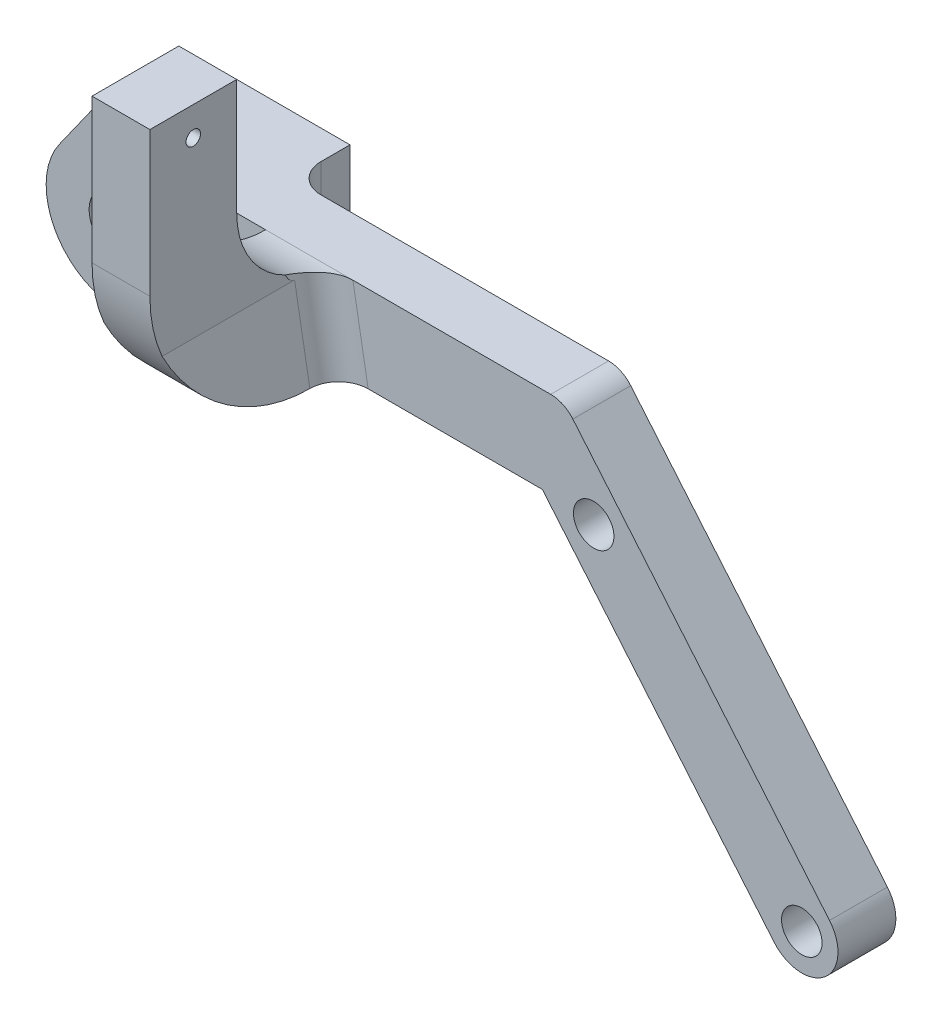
ISO-10303-21;
HEADER;
FILE_DESCRIPTION(('STEP AP214'),'2;1');
FILE_NAME('part.step','',(''),(''),'','','');
FILE_SCHEMA(('AUTOMOTIVE_DESIGN { 1 0 10303 214 1 1 1 1 }'));
ENDSEC;
DATA;
#1=APPLICATION_CONTEXT('core data for automotive mechanical design processes');
#2=APPLICATION_PROTOCOL_DEFINITION('international standard','automotive_design',2000,#1);
#3=PRODUCT_CONTEXT('',#1,'mechanical');
#4=PRODUCT('Part','Part','',(#3));
#5=PRODUCT_RELATED_PRODUCT_CATEGORY('part','',(#4));
#6=PRODUCT_DEFINITION_FORMATION('','',#4);
#7=PRODUCT_DEFINITION_CONTEXT('part definition',#1,'design');
#8=PRODUCT_DEFINITION('design','',#6,#7);
#9=PRODUCT_DEFINITION_SHAPE('','',#8);
#10=(LENGTH_UNIT() NAMED_UNIT(*) SI_UNIT(.MILLI.,.METRE.));
#11=(NAMED_UNIT(*) PLANE_ANGLE_UNIT() SI_UNIT($,.RADIAN.));
#12=(NAMED_UNIT(*) SI_UNIT($,.STERADIAN.) SOLID_ANGLE_UNIT());
#13=UNCERTAINTY_MEASURE_WITH_UNIT(LENGTH_MEASURE(1.E-05),#10,'distance_accuracy_value','');
#14=(GEOMETRIC_REPRESENTATION_CONTEXT(3) GLOBAL_UNCERTAINTY_ASSIGNED_CONTEXT((#13)) GLOBAL_UNIT_ASSIGNED_CONTEXT((#10,
#11,#12)) REPRESENTATION_CONTEXT('',''));
#15=CARTESIAN_POINT('',(0.,0.,0.));
#16=DIRECTION('',(0.,0.,1.));
#17=DIRECTION('',(1.,0.,0.));
#18=AXIS2_PLACEMENT_3D('',#15,#16,#17);
#19=CARTESIAN_POINT('',(16.9667619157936,11.9984192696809,2.54));
#20=DIRECTION('',(0.,0.,-1.));
#21=DIRECTION('',(1.,0.,0.));
#22=AXIS2_PLACEMENT_3D('',#19,#20,#21);
#23=PLANE('',#22);
#24=CARTESIAN_POINT('',(46.7893875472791,3.26204592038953,2.54));
#25=DIRECTION('',(0.,0.,-1.));
#26=DIRECTION('',(-1.,0.,0.));
#27=AXIS2_PLACEMENT_3D('',#24,#25,#26);
#28=CIRCLE('',#27,1.778);
#29=CARTESIAN_POINT('',(45.0113875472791,3.26204592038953,2.54));
#30=VERTEX_POINT('',#29);
#31=EDGE_CURVE('E392',#30,#30,#28,.T.);
#32=ORIENTED_EDGE('',*,*,#31,.F.);
#33=EDGE_LOOP('',(#32));
#34=FACE_BOUND('',#33,.T.);
#35=CARTESIAN_POINT('',(65.0583983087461,-18.5101132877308,2.54));
#36=DIRECTION('',(0.,0.,-1.));
#37=DIRECTION('',(-1.,0.,0.));
#38=AXIS2_PLACEMENT_3D('',#35,#36,#37);
#39=CIRCLE('',#38,1.77800000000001);
#40=CARTESIAN_POINT('',(63.2803983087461,-18.5101132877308,2.54));
#41=VERTEX_POINT('',#40);
#42=EDGE_CURVE('E387',#41,#41,#39,.T.);
#43=ORIENTED_EDGE('',*,*,#42,.F.);
#44=EDGE_LOOP('',(#43));
#45=FACE_BOUND('',#44,.T.);
#46=DIRECTION('',(-0.642787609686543,0.766044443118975,0.));
#47=VECTOR('',#46,1.);
#48=CARTESIAN_POINT('',(26.6311926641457,22.346223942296,2.54));
#49=LINE('',#48,#47);
#50=CARTESIAN_POINT('',(62.6262072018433,-20.5509639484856,2.54));
#51=VERTEX_POINT('',#50);
#52=CARTESIAN_POINT('',(42.5058682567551,3.42752227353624,2.54));
#53=VERTEX_POINT('',#52);
#54=EDGE_CURVE('E400',#51,#53,#49,.T.);
#55=ORIENTED_EDGE('',*,*,#54,.T.);
#56=CARTESIAN_POINT('',(44.4516211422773,5.06020280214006,2.54));
#57=DIRECTION('',(0.,0.,-1.));
#58=DIRECTION('',(-1.,0.,0.));
#59=AXIS2_PLACEMENT_3D('',#56,#57,#58);
#60=CIRCLE('',#59,2.54);
#61=CARTESIAN_POINT('',(42.3117442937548,3.69179969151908,2.54));
#62=VERTEX_POINT('',#61);
#63=EDGE_CURVE('E463',#53,#62,#60,.T.);
#64=ORIENTED_EDGE('',*,*,#63,.T.);
#65=DIRECTION('',(-1.,0.,0.));
#66=VECTOR('',#65,1.);
#67=CARTESIAN_POINT('',(0.,3.69179969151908,2.54));
#68=LINE('',#67,#66);
#69=CARTESIAN_POINT('',(17.78,3.69179969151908,2.54));
#70=VERTEX_POINT('',#69);
#71=EDGE_CURVE('E396',#62,#70,#68,.T.);
#72=ORIENTED_EDGE('',*,*,#71,.T.);
#73=DIRECTION('',(0.,1.,0.));
#74=VECTOR('',#73,1.);
#75=CARTESIAN_POINT('',(17.78,11.2863996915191,2.54));
#76=LINE('',#75,#74);
#77=CARTESIAN_POINT('',(17.78,11.2863996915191,2.54));
#78=VERTEX_POINT('',#77);
#79=EDGE_CURVE('E446',#70,#78,#76,.T.);
#80=ORIENTED_EDGE('',*,*,#79,.T.);
#81=DIRECTION('',(1.,0.,0.));
#82=VECTOR('',#81,1.);
#83=CARTESIAN_POINT('',(0.,11.2863996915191,2.54));
#84=LINE('',#83,#82);
#85=CARTESIAN_POINT('',(43.0164019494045,11.2863996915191,2.54));
#86=VERTEX_POINT('',#85);
#87=EDGE_CURVE('E395',#78,#86,#84,.T.);
#88=ORIENTED_EDGE('',*,*,#87,.T.);
#89=CARTESIAN_POINT('',(43.0164019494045,8.74639969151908,2.54));
#90=DIRECTION('',(0.,0.,-1.));
#91=DIRECTION('',(-1.,0.,0.));
#92=AXIS2_PLACEMENT_3D('',#89,#90,#91);
#93=CIRCLE('',#92,2.54);
#94=CARTESIAN_POINT('',(44.9621548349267,10.3790802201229,2.54));
#95=VERTEX_POINT('',#94);
#96=EDGE_CURVE('E461',#86,#95,#93,.T.);
#97=ORIENTED_EDGE('',*,*,#96,.T.);
#98=DIRECTION('',(0.642787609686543,-0.766044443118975,0.));
#99=VECTOR('',#98,1.);
#100=CARTESIAN_POINT('',(31.4955748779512,26.4279252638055,2.54));
#101=LINE('',#100,#99);
#102=CARTESIAN_POINT('',(67.4905894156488,-16.4692626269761,2.54));
#103=VERTEX_POINT('',#102);
#104=EDGE_CURVE('E406',#95,#103,#101,.T.);
#105=ORIENTED_EDGE('',*,*,#104,.T.);
#106=CARTESIAN_POINT('',(65.0583983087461,-18.5101132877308,2.54));
#107=DIRECTION('',(0.,0.,-1.));
#108=DIRECTION('',(-1.,0.,0.));
#109=AXIS2_PLACEMENT_3D('',#106,#107,#108);
#110=CIRCLE('',#109,3.175);
#111=EDGE_CURVE('E403',#103,#51,#110,.T.);
#112=ORIENTED_EDGE('',*,*,#111,.T.);
#113=EDGE_LOOP('',(#55,#64,#72,#80,#88,#97,#105,#112));
#114=FACE_BOUND('',#113,.T.);
#115=ADVANCED_FACE('F109',(#34,#45,#114),#23,.T.);
#116=CARTESIAN_POINT('',(23.0767428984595,0.,22.86));
#117=DIRECTION('',(-1.,0.,0.));
#118=DIRECTION('',(0.,-1.,0.));
#119=AXIS2_PLACEMENT_3D('',#116,#117,#118);
#120=PLANE('',#119);
#121=CARTESIAN_POINT('',(23.0767428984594,26.5263996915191,19.05));
#122=DIRECTION('',(-1.,0.,0.));
#123=DIRECTION('',(0.,-1.,0.));
#124=AXIS2_PLACEMENT_3D('',#121,#122,#123);
#125=CIRCLE('',#124,0.634999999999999);
#126=CARTESIAN_POINT('',(23.0767428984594,25.8913996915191,19.05));
#127=VERTEX_POINT('',#126);
#128=EDGE_CURVE('E932',#127,#127,#125,.T.);
#129=ORIENTED_EDGE('',*,*,#128,.T.);
#130=EDGE_LOOP('',(#129));
#131=FACE_BOUND('',#130,.T.);
#132=DIRECTION('',(0.,1.,0.));
#133=VECTOR('',#132,1.);
#134=CARTESIAN_POINT('',(23.0767428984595,0.,22.86));
#135=LINE('',#134,#133);
#136=CARTESIAN_POINT('',(23.0767428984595,16.3917996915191,22.86));
#137=VERTEX_POINT('',#136);
#138=CARTESIAN_POINT('',(23.0767428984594,29.0663996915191,22.86));
#139=VERTEX_POINT('',#138);
#140=EDGE_CURVE('E322',#137,#139,#135,.T.);
#141=ORIENTED_EDGE('',*,*,#140,.F.);
#142=CARTESIAN_POINT('',(23.0767428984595,16.3917996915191,10.16));
#143=DIRECTION('',(-1.,0.,0.));
#144=DIRECTION('',(0.,-1.,0.));
#145=AXIS2_PLACEMENT_3D('',#142,#143,#144);
#146=CIRCLE('',#145,12.7);
#147=CARTESIAN_POINT('',(23.0767428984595,11.2863996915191,21.7886237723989));
#148=VERTEX_POINT('',#147);
#149=EDGE_CURVE('E117',#137,#148,#146,.F.);
#150=ORIENTED_EDGE('',*,*,#149,.T.);
#151=DIRECTION('',(0.,0.,-1.));
#152=VECTOR('',#151,1.);
#153=CARTESIAN_POINT('',(23.0767428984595,11.2863996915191,22.86));
#154=LINE('',#153,#152);
#155=CARTESIAN_POINT('',(23.0767428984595,11.2863996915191,10.16));
#156=VERTEX_POINT('',#155);
#157=EDGE_CURVE('E315',#148,#156,#154,.T.);
#158=ORIENTED_EDGE('',*,*,#157,.T.);
#159=CARTESIAN_POINT('',(23.0767428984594,25.9136767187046,10.16));
#160=DIRECTION('',(-1.,0.,0.));
#161=DIRECTION('',(0.,-1.,0.));
#162=AXIS2_PLACEMENT_3D('',#159,#160,#161);
#163=ELLIPSE('',#162,14.6272770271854,2.54);
#164=CARTESIAN_POINT('',(23.0767428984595,12.0663803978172,10.9783531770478));
#165=VERTEX_POINT('',#164);
#166=EDGE_CURVE('E631',#156,#165,#163,.T.);
#167=ORIENTED_EDGE('',*,*,#166,.T.);
#168=CARTESIAN_POINT('',(23.0767428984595,18.9063996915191,7.62));
#169=DIRECTION('',(-1.,0.,0.));
#170=DIRECTION('',(0.,-1.,0.));
#171=AXIS2_PLACEMENT_3D('',#168,#169,#170);
#172=CIRCLE('',#171,7.62);
#173=CARTESIAN_POINT('',(23.0767428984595,18.9063996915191,15.24));
#174=VERTEX_POINT('',#173);
#175=EDGE_CURVE('E503',#165,#174,#172,.T.);
#176=ORIENTED_EDGE('',*,*,#175,.T.);
#177=DIRECTION('',(0.,-1.,0.));
#178=VECTOR('',#177,1.);
#179=CARTESIAN_POINT('',(23.0767428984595,0.,15.24));
#180=LINE('',#179,#178);
#181=CARTESIAN_POINT('',(23.0767428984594,29.0663996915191,15.24));
#182=VERTEX_POINT('',#181);
#183=EDGE_CURVE('E298',#182,#174,#180,.T.);
#184=ORIENTED_EDGE('',*,*,#183,.F.);
#185=DIRECTION('',(0.,0.,-1.));
#186=VECTOR('',#185,1.);
#187=CARTESIAN_POINT('',(23.0767428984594,29.0663996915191,22.86));
#188=LINE('',#187,#186);
#189=EDGE_CURVE('E307',#139,#182,#188,.T.);
#190=ORIENTED_EDGE('',*,*,#189,.F.);
#191=EDGE_LOOP('',(#141,#150,#158,#167,#176,#184,#190));
#192=FACE_BOUND('',#191,.T.);
#193=ADVANCED_FACE('F542',(#131,#192),#120,.F.);
#194=CARTESIAN_POINT('',(0.,29.0663996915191,22.86));
#195=DIRECTION('',(0.,-1.,0.));
#196=DIRECTION('',(1.,0.,0.));
#197=AXIS2_PLACEMENT_3D('',#194,#195,#196);
#198=PLANE('',#197);
#199=DIRECTION('',(1.,0.,0.));
#200=VECTOR('',#199,1.);
#201=CARTESIAN_POINT('',(0.,29.0663996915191,15.24));
#202=LINE('',#201,#200);
#203=CARTESIAN_POINT('',(17.9967428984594,29.0663996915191,15.24));
#204=VERTEX_POINT('',#203);
#205=EDGE_CURVE('E291',#204,#182,#202,.T.);
#206=ORIENTED_EDGE('',*,*,#205,.F.);
#207=DIRECTION('',(0.,0.,-1.));
#208=VECTOR('',#207,1.);
#209=CARTESIAN_POINT('',(17.9967428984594,29.0663996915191,22.86));
#210=LINE('',#209,#208);
#211=CARTESIAN_POINT('',(17.9967428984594,29.0663996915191,22.86));
#212=VERTEX_POINT('',#211);
#213=EDGE_CURVE('E305',#212,#204,#210,.T.);
#214=ORIENTED_EDGE('',*,*,#213,.F.);
#215=DIRECTION('',(-1.,0.,0.));
#216=VECTOR('',#215,1.);
#217=CARTESIAN_POINT('',(0.,29.0663996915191,22.86));
#218=LINE('',#217,#216);
#219=EDGE_CURVE('E642',#139,#212,#218,.T.);
#220=ORIENTED_EDGE('',*,*,#219,.F.);
#221=ORIENTED_EDGE('',*,*,#189,.T.);
#222=EDGE_LOOP('',(#206,#214,#220,#221));
#223=FACE_BOUND('',#222,.T.);
#224=ADVANCED_FACE('F303',(#223),#198,.F.);
#225=CARTESIAN_POINT('',(17.9967428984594,0.,22.86));
#226=DIRECTION('',(-1.,0.,0.));
#227=DIRECTION('',(0.,-1.,0.));
#228=AXIS2_PLACEMENT_3D('',#225,#226,#227);
#229=PLANE('',#228);
#230=CARTESIAN_POINT('',(17.9967428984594,26.5263996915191,19.05));
#231=DIRECTION('',(-1.,0.,0.));
#232=DIRECTION('',(0.,-1.,0.));
#233=AXIS2_PLACEMENT_3D('',#230,#231,#232);
#234=CIRCLE('',#233,0.634999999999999);
#235=CARTESIAN_POINT('',(17.9967428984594,25.8913996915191,19.05));
#236=VERTEX_POINT('',#235);
#237=EDGE_CURVE('E931',#236,#236,#234,.T.);
#238=ORIENTED_EDGE('',*,*,#237,.F.);
#239=EDGE_LOOP('',(#238));
#240=FACE_BOUND('',#239,.T.);
#241=DIRECTION('',(0.,0.,-1.));
#242=VECTOR('',#241,1.);
#243=CARTESIAN_POINT('',(17.9967428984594,11.2863996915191,22.86));
#244=LINE('',#243,#242);
#245=CARTESIAN_POINT('',(17.9967428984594,11.2863996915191,21.7886237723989));
#246=VERTEX_POINT('',#245);
#247=CARTESIAN_POINT('',(17.9967428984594,11.2863996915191,7.62));
#248=VERTEX_POINT('',#247);
#249=EDGE_CURVE('E313',#246,#248,#244,.T.);
#250=ORIENTED_EDGE('',*,*,#249,.F.);
#251=CARTESIAN_POINT('',(17.9967428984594,16.3917996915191,10.16));
#252=DIRECTION('',(-1.,0.,0.));
#253=DIRECTION('',(0.,-1.,0.));
#254=AXIS2_PLACEMENT_3D('',#251,#252,#253);
#255=CIRCLE('',#254,12.7);
#256=CARTESIAN_POINT('',(17.9967428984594,16.3917996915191,22.86));
#257=VERTEX_POINT('',#256);
#258=EDGE_CURVE('E637',#246,#257,#255,.T.);
#259=ORIENTED_EDGE('',*,*,#258,.T.);
#260=DIRECTION('',(0.,1.,0.));
#261=VECTOR('',#260,1.);
#262=CARTESIAN_POINT('',(17.9967428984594,0.,22.86));
#263=LINE('',#262,#261);
#264=EDGE_CURVE('E308',#257,#212,#263,.T.);
#265=ORIENTED_EDGE('',*,*,#264,.T.);
#266=ORIENTED_EDGE('',*,*,#213,.T.);
#267=DIRECTION('',(0.,-1.,0.));
#268=VECTOR('',#267,1.);
#269=CARTESIAN_POINT('',(17.9967428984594,0.,15.24));
#270=LINE('',#269,#268);
#271=CARTESIAN_POINT('',(17.9967428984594,18.9063996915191,15.24));
#272=VERTEX_POINT('',#271);
#273=EDGE_CURVE('E287',#204,#272,#270,.T.);
#274=ORIENTED_EDGE('',*,*,#273,.T.);
#275=CARTESIAN_POINT('',(17.9967428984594,18.9063996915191,7.62));
#276=DIRECTION('',(-1.,0.,0.));
#277=DIRECTION('',(0.,-1.,0.));
#278=AXIS2_PLACEMENT_3D('',#275,#276,#277);
#279=CIRCLE('',#278,7.62);
#280=EDGE_CURVE('E495',#272,#248,#279,.F.);
#281=ORIENTED_EDGE('',*,*,#280,.T.);
#282=EDGE_LOOP('',(#250,#259,#265,#266,#274,#281));
#283=FACE_BOUND('',#282,.T.);
#284=ADVANCED_FACE('F311',(#240,#283),#229,.T.);
#285=CARTESIAN_POINT('',(16.9667619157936,11.9984192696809,7.62));
#286=DIRECTION('',(0.,0.,-1.));
#287=DIRECTION('',(1.,0.,0.));
#288=AXIS2_PLACEMENT_3D('',#285,#286,#287);
#289=PLANE('',#288);
#290=CARTESIAN_POINT('',(65.0583983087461,-18.5101132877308,7.62));
#291=DIRECTION('',(0.,0.,-1.));
#292=DIRECTION('',(-1.,0.,0.));
#293=AXIS2_PLACEMENT_3D('',#290,#291,#292);
#294=CIRCLE('',#293,1.77800000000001);
#295=CARTESIAN_POINT('',(63.2803983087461,-18.5101132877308,7.62));
#296=VERTEX_POINT('',#295);
#297=EDGE_CURVE('E391',#296,#296,#294,.F.);
#298=ORIENTED_EDGE('',*,*,#297,.F.);
#299=EDGE_LOOP('',(#298));
#300=FACE_BOUND('',#299,.T.);
#301=CARTESIAN_POINT('',(46.7893875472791,3.26204592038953,7.62));
#302=DIRECTION('',(0.,0.,-1.));
#303=DIRECTION('',(-1.,0.,0.));
#304=AXIS2_PLACEMENT_3D('',#301,#302,#303);
#305=CIRCLE('',#304,1.778);
#306=CARTESIAN_POINT('',(45.0113875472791,3.26204592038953,7.62));
#307=VERTEX_POINT('',#306);
#308=EDGE_CURVE('E390',#307,#307,#305,.F.);
#309=ORIENTED_EDGE('',*,*,#308,.F.);
#310=EDGE_LOOP('',(#309));
#311=FACE_BOUND('',#310,.T.);
#312=DIRECTION('',(1.,0.,0.));
#313=VECTOR('',#312,1.);
#314=CARTESIAN_POINT('',(0.,3.69179969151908,7.62));
#315=LINE('',#314,#313);
#316=CARTESIAN_POINT('',(26.9950593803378,3.69179969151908,7.62));
#317=VERTEX_POINT('',#316);
#318=CARTESIAN_POINT('',(42.3117442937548,3.69179969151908,7.62));
#319=VERTEX_POINT('',#318);
#320=EDGE_CURVE('E399',#317,#319,#315,.T.);
#321=ORIENTED_EDGE('',*,*,#320,.T.);
#322=CARTESIAN_POINT('',(44.4516211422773,5.06020280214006,7.62));
#323=DIRECTION('',(0.,0.,-1.));
#324=DIRECTION('',(-1.,0.,0.));
#325=AXIS2_PLACEMENT_3D('',#322,#323,#324);
#326=CIRCLE('',#325,2.54);
#327=CARTESIAN_POINT('',(42.5058682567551,3.42752227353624,7.62));
#328=VERTEX_POINT('',#327);
#329=EDGE_CURVE('E467',#319,#328,#326,.F.);
#330=ORIENTED_EDGE('',*,*,#329,.T.);
#331=DIRECTION('',(0.642787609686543,-0.766044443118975,0.));
#332=VECTOR('',#331,1.);
#333=CARTESIAN_POINT('',(26.6311926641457,22.346223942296,7.62));
#334=LINE('',#333,#332);
#335=CARTESIAN_POINT('',(62.6262072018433,-20.5509639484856,7.62));
#336=VERTEX_POINT('',#335);
#337=EDGE_CURVE('E424',#328,#336,#334,.T.);
#338=ORIENTED_EDGE('',*,*,#337,.T.);
#339=CARTESIAN_POINT('',(65.0583983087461,-18.5101132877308,7.62));
#340=DIRECTION('',(0.,0.,-1.));
#341=DIRECTION('',(-1.,0.,0.));
#342=AXIS2_PLACEMENT_3D('',#339,#340,#341);
#343=CIRCLE('',#342,3.175);
#344=CARTESIAN_POINT('',(67.4905894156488,-16.4692626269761,7.62));
#345=VERTEX_POINT('',#344);
#346=EDGE_CURVE('E426',#336,#345,#343,.F.);
#347=ORIENTED_EDGE('',*,*,#346,.T.);
#348=DIRECTION('',(-0.642787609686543,0.766044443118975,0.));
#349=VECTOR('',#348,1.);
#350=CARTESIAN_POINT('',(31.4955748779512,26.4279252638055,7.62));
#351=LINE('',#350,#349);
#352=CARTESIAN_POINT('',(44.9621548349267,10.3790802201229,7.62));
#353=VERTEX_POINT('',#352);
#354=EDGE_CURVE('E428',#345,#353,#351,.T.);
#355=ORIENTED_EDGE('',*,*,#354,.T.);
#356=CARTESIAN_POINT('',(43.0164019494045,8.74639969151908,7.62));
#357=DIRECTION('',(0.,0.,-1.));
#358=DIRECTION('',(-1.,0.,0.));
#359=AXIS2_PLACEMENT_3D('',#356,#357,#358);
#360=CIRCLE('',#359,2.54);
#361=CARTESIAN_POINT('',(43.0164019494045,11.2863996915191,7.62));
#362=VERTEX_POINT('',#361);
#363=EDGE_CURVE('E465',#353,#362,#360,.F.);
#364=ORIENTED_EDGE('',*,*,#363,.T.);
#365=DIRECTION('',(-1.,0.,0.));
#366=VECTOR('',#365,1.);
#367=CARTESIAN_POINT('',(0.,11.2863996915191,7.62));
#368=LINE('',#367,#366);
#369=CARTESIAN_POINT('',(25.6559264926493,11.2863996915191,7.62));
#370=VERTEX_POINT('',#369);
#371=EDGE_CURVE('E432',#362,#370,#368,.T.);
#372=ORIENTED_EDGE('',*,*,#371,.T.);
#373=DIRECTION('',(0.173648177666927,-0.984807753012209,0.));
#374=VECTOR('',#373,1.);
#375=CARTESIAN_POINT('',(25.2721536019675,13.4628839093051,7.62));
#376=LINE('',#375,#374);
#377=EDGE_CURVE('E440',#370,#317,#376,.T.);
#378=ORIENTED_EDGE('',*,*,#377,.T.);
#379=EDGE_LOOP('',(#321,#330,#338,#347,#355,#364,#372,#378));
#380=FACE_BOUND('',#379,.T.);
#381=ADVANCED_FACE('F560',(#300,#311,#380),#289,.F.);
#382=CARTESIAN_POINT('',(10.16,3.69179969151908,7.62));
#383=VERTEX_POINT('',#382);
#384=CARTESIAN_POINT('',(19.3358757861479,3.69179969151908,7.62));
#385=VERTEX_POINT('',#384);
#386=EDGE_CURVE('E421',#383,#385,#315,.T.);
#387=ORIENTED_EDGE('',*,*,#386,.T.);
#388=DIRECTION('',(-0.173648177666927,0.984807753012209,0.));
#389=VECTOR('',#388,1.);
#390=CARTESIAN_POINT('',(17.8439226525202,12.1530863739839,7.62));
#391=LINE('',#390,#389);
#392=EDGE_CURVE('E323',#385,#248,#391,.T.);
#393=ORIENTED_EDGE('',*,*,#392,.T.);
#394=CARTESIAN_POINT('',(10.16,11.2863996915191,7.62));
#395=VERTEX_POINT('',#394);
#396=EDGE_CURVE('E431',#248,#395,#368,.T.);
#397=ORIENTED_EDGE('',*,*,#396,.T.);
#398=DIRECTION('',(0.,-1.,0.));
#399=VECTOR('',#398,1.);
#400=CARTESIAN_POINT('',(10.16,11.9984192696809,7.62));
#401=LINE('',#400,#399);
#402=EDGE_CURVE('E343',#395,#383,#401,.T.);
#403=ORIENTED_EDGE('',*,*,#402,.T.);
#404=EDGE_LOOP('',(#387,#393,#397,#403));
#405=FACE_BOUND('',#404,.T.);
#406=ADVANCED_FACE('F556',(#405),#289,.F.);
#407=CARTESIAN_POINT('',(0.,11.2863996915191,89.1663302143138));
#408=DIRECTION('',(0.,1.,0.));
#409=DIRECTION('',(0.,0.,1.));
#410=AXIS2_PLACEMENT_3D('',#407,#408,#409);
#411=PLANE('',#410);
#412=ORIENTED_EDGE('',*,*,#396,.F.);
#413=DIRECTION('',(-1.,0.,0.));
#414=VECTOR('',#413,1.);
#415=CARTESIAN_POINT('',(23.0767428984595,11.2863996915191,7.62));
#416=LINE('',#415,#414);
#417=EDGE_CURVE('E493',#248,#370,#416,.F.);
#418=ORIENTED_EDGE('',*,*,#417,.T.);
#419=ORIENTED_EDGE('',*,*,#371,.F.);
#420=DIRECTION('',(0.,0.,-1.));
#421=VECTOR('',#420,1.);
#422=CARTESIAN_POINT('',(43.0164019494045,11.2863996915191,89.1663302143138));
#423=LINE('',#422,#421);
#424=EDGE_CURVE('E471',#362,#86,#423,.T.);
#425=ORIENTED_EDGE('',*,*,#424,.T.);
#426=ORIENTED_EDGE('',*,*,#87,.F.);
#427=CARTESIAN_POINT('',(17.78,11.2863996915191,0.));
#428=DIRECTION('',(0.,1.,0.));
#429=DIRECTION('',(0.,0.,1.));
#430=AXIS2_PLACEMENT_3D('',#427,#428,#429);
#431=CIRCLE('',#430,2.54);
#432=CARTESIAN_POINT('',(15.24,11.2863996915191,0.));
#433=VERTEX_POINT('',#432);
#434=EDGE_CURVE('E454',#78,#433,#431,.F.);
#435=ORIENTED_EDGE('',*,*,#434,.T.);
#436=DIRECTION('',(0.,0.,1.));
#437=VECTOR('',#436,1.);
#438=CARTESIAN_POINT('',(15.24,11.2863996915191,-2.54));
#439=LINE('',#438,#437);
#440=CARTESIAN_POINT('',(15.24,11.2863996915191,-2.54));
#441=VERTEX_POINT('',#440);
#442=EDGE_CURVE('E378',#441,#433,#439,.T.);
#443=ORIENTED_EDGE('',*,*,#442,.F.);
#444=DIRECTION('',(1.,0.,0.));
#445=VECTOR('',#444,1.);
#446=CARTESIAN_POINT('',(0.,11.2863996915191,-2.54));
#447=LINE('',#446,#445);
#448=CARTESIAN_POINT('',(1.52968776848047,11.2863996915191,-2.54));
#449=VERTEX_POINT('',#448);
#450=EDGE_CURVE('E364',#449,#441,#447,.T.);
#451=ORIENTED_EDGE('',*,*,#450,.F.);
#452=DIRECTION('',(0.,0.,-1.));
#453=VECTOR('',#452,1.);
#454=CARTESIAN_POINT('',(1.52968776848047,11.2863996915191,89.1663302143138));
#455=LINE('',#454,#453);
#456=CARTESIAN_POINT('',(1.52968776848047,11.2863996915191,2.54));
#457=VERTEX_POINT('',#456);
#458=EDGE_CURVE('E469',#449,#457,#455,.F.);
#459=ORIENTED_EDGE('',*,*,#458,.T.);
#460=DIRECTION('',(1.,0.,0.));
#461=VECTOR('',#460,1.);
#462=CARTESIAN_POINT('',(16.9667619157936,11.2863996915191,2.54));
#463=LINE('',#462,#461);
#464=CARTESIAN_POINT('',(10.16,11.2863996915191,2.54));
#465=VERTEX_POINT('',#464);
#466=EDGE_CURVE('E338',#457,#465,#463,.T.);
#467=ORIENTED_EDGE('',*,*,#466,.T.);
#468=DIRECTION('',(0.,0.,1.));
#469=VECTOR('',#468,1.);
#470=CARTESIAN_POINT('',(10.16,11.2863996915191,-21.6182841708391));
#471=LINE('',#470,#469);
#472=EDGE_CURVE('E347',#465,#395,#471,.T.);
#473=ORIENTED_EDGE('',*,*,#472,.T.);
#474=EDGE_LOOP('',(#412,#418,#419,#425,#426,#435,#443,#451,#459,#467,#473));
#475=FACE_BOUND('',#474,.T.);
#476=ADVANCED_FACE('F559',(#475),#411,.T.);
#477=CARTESIAN_POINT('',(0.,3.69179969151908,89.1663302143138));
#478=DIRECTION('',(0.,-1.,0.));
#479=DIRECTION('',(0.,0.,-1.));
#480=AXIS2_PLACEMENT_3D('',#477,#478,#479);
#481=PLANE('',#480);
#482=CARTESIAN_POINT('',(26.9950593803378,3.69179969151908,10.16));
#483=DIRECTION('',(0.,-1.,0.));
#484=DIRECTION('',(1.,0.,0.));
#485=AXIS2_PLACEMENT_3D('',#482,#483,#484);
#486=ELLIPSE('',#485,2.57918359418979,2.54);
#487=CARTESIAN_POINT('',(24.415875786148,3.69179969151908,10.16));
#488=VERTEX_POINT('',#487);
#489=EDGE_CURVE('E451',#317,#488,#486,.F.);
#490=ORIENTED_EDGE('',*,*,#489,.T.);
#491=DIRECTION('',(-1.,0.,0.));
#492=VECTOR('',#491,1.);
#493=CARTESIAN_POINT('',(19.3358757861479,3.69179969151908,10.16));
#494=LINE('',#493,#492);
#495=CARTESIAN_POINT('',(19.3358757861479,3.69179969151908,10.16));
#496=VERTEX_POINT('',#495);
#497=EDGE_CURVE('E632',#488,#496,#494,.T.);
#498=ORIENTED_EDGE('',*,*,#497,.T.);
#499=DIRECTION('',(0.,0.,-1.));
#500=VECTOR('',#499,1.);
#501=CARTESIAN_POINT('',(19.3358757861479,3.69179969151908,22.86));
#502=LINE('',#501,#500);
#503=EDGE_CURVE('E317',#496,#385,#502,.T.);
#504=ORIENTED_EDGE('',*,*,#503,.T.);
#505=ORIENTED_EDGE('',*,*,#386,.F.);
#506=DIRECTION('',(0.,0.,1.));
#507=VECTOR('',#506,1.);
#508=CARTESIAN_POINT('',(10.16,3.69179969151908,-21.6182841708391));
#509=LINE('',#508,#507);
#510=CARTESIAN_POINT('',(10.16,3.69179969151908,2.54));
#511=VERTEX_POINT('',#510);
#512=EDGE_CURVE('E346',#511,#383,#509,.T.);
#513=ORIENTED_EDGE('',*,*,#512,.F.);
#514=DIRECTION('',(-1.,0.,0.));
#515=VECTOR('',#514,1.);
#516=CARTESIAN_POINT('',(16.9667619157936,3.69179969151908,2.54));
#517=LINE('',#516,#515);
#518=CARTESIAN_POINT('',(9.95784650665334,3.69179969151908,2.54));
#519=VERTEX_POINT('',#518);
#520=EDGE_CURVE('E332',#511,#519,#517,.T.);
#521=ORIENTED_EDGE('',*,*,#520,.T.);
#522=DIRECTION('',(0.,0.,-1.));
#523=VECTOR('',#522,1.);
#524=CARTESIAN_POINT('',(9.95784650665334,3.69179969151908,-2.54));
#525=LINE('',#524,#523);
#526=CARTESIAN_POINT('',(9.95784650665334,3.69179969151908,-2.54));
#527=VERTEX_POINT('',#526);
#528=EDGE_CURVE('E483',#519,#527,#525,.T.);
#529=ORIENTED_EDGE('',*,*,#528,.T.);
#530=DIRECTION('',(-1.,0.,0.));
#531=VECTOR('',#530,1.);
#532=CARTESIAN_POINT('',(0.,3.69179969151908,-2.54));
#533=LINE('',#532,#531);
#534=CARTESIAN_POINT('',(15.24,3.69179969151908,-2.54));
#535=VERTEX_POINT('',#534);
#536=EDGE_CURVE('E369',#535,#527,#533,.T.);
#537=ORIENTED_EDGE('',*,*,#536,.F.);
#538=DIRECTION('',(0.,0.,1.));
#539=VECTOR('',#538,1.);
#540=CARTESIAN_POINT('',(15.24,3.69179969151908,-2.54));
#541=LINE('',#540,#539);
#542=CARTESIAN_POINT('',(15.24,3.69179969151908,0.));
#543=VERTEX_POINT('',#542);
#544=EDGE_CURVE('E375',#535,#543,#541,.T.);
#545=ORIENTED_EDGE('',*,*,#544,.T.);
#546=CARTESIAN_POINT('',(17.78,3.69179969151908,0.));
#547=DIRECTION('',(0.,-1.,0.));
#548=DIRECTION('',(0.,0.,-1.));
#549=AXIS2_PLACEMENT_3D('',#546,#547,#548);
#550=CIRCLE('',#549,2.54);
#551=EDGE_CURVE('E456',#543,#70,#550,.F.);
#552=ORIENTED_EDGE('',*,*,#551,.T.);
#553=ORIENTED_EDGE('',*,*,#71,.F.);
#554=DIRECTION('',(0.,0.,-1.));
#555=VECTOR('',#554,1.);
#556=CARTESIAN_POINT('',(42.3117442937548,3.69179969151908,89.1663302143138));
#557=LINE('',#556,#555);
#558=EDGE_CURVE('E386',#319,#62,#557,.T.);
#559=ORIENTED_EDGE('',*,*,#558,.F.);
#560=ORIENTED_EDGE('',*,*,#320,.F.);
#561=EDGE_LOOP('',(#490,#498,#504,#505,#513,#521,#529,#537,#545,#552,#553,#559,#560));
#562=FACE_BOUND('',#561,.T.);
#563=ADVANCED_FACE('F567',(#562),#481,.T.);
#564=CARTESIAN_POINT('',(-16.9667619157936,11.9984192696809,2.54));
#565=DIRECTION('',(0.,0.,1.));
#566=DIRECTION('',(-1.,0.,0.));
#567=AXIS2_PLACEMENT_3D('',#564,#565,#566);
#568=CYLINDRICAL_SURFACE('',#567,14.4305937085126);
#569=DIRECTION('',(0.,0.,1.));
#570=VECTOR('',#569,1.);
#571=CARTESIAN_POINT('',(-5.18459384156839,3.66639969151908,2.54));
#572=LINE('',#571,#570);
#573=CARTESIAN_POINT('',(-5.18459384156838,3.66639969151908,-2.54));
#574=VERTEX_POINT('',#573);
#575=CARTESIAN_POINT('',(-5.18459384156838,3.66639969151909,2.54));
#576=VERTEX_POINT('',#575);
#577=EDGE_CURVE('E435',#574,#576,#572,.T.);
#578=ORIENTED_EDGE('',*,*,#577,.T.);
#579=DIRECTION('',(0.578291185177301,0.815830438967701,0.));
#580=VECTOR('',#579,1.);
#581=CARTESIAN_POINT('',(6.15421787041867,19.6627556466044,2.54));
#582=LINE('',#581,#580);
#583=CARTESIAN_POINT('',(-5.18052098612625,3.67215227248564,2.54));
#584=VERTEX_POINT('',#583);
#585=EDGE_CURVE('E340',#576,#584,#582,.T.);
#586=ORIENTED_EDGE('',*,*,#585,.T.);
#587=DIRECTION('',(0.,0.,-1.));
#588=VECTOR('',#587,1.);
#589=CARTESIAN_POINT('',(-5.18052788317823,3.67215227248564,12.7));
#590=LINE('',#589,#588);
#591=CARTESIAN_POINT('',(-5.18052788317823,3.67215227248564,-2.54));
#592=VERTEX_POINT('',#591);
#593=EDGE_CURVE('E384',#584,#592,#590,.T.);
#594=ORIENTED_EDGE('',*,*,#593,.T.);
#595=CARTESIAN_POINT('',(-16.9667619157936,11.9984192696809,-2.54));
#596=DIRECTION('',(0.,0.,-1.));
#597=DIRECTION('',(-1.,0.,0.));
#598=AXIS2_PLACEMENT_3D('',#595,#596,#597);
#599=CIRCLE('',#598,14.4305937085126);
#600=EDGE_CURVE('E358',#574,#592,#599,.F.);
#601=ORIENTED_EDGE('',*,*,#600,.F.);
#602=EDGE_LOOP('',(#578,#586,#594,#601));
#603=FACE_BOUND('',#602,.T.);
#604=ADVANCED_FACE('F564',(#603),#568,.F.);
#605=CARTESIAN_POINT('',(0.,0.,2.54));
#606=DIRECTION('',(0.,0.,1.));
#607=DIRECTION('',(-1.,0.,0.));
#608=AXIS2_PLACEMENT_3D('',#605,#606,#607);
#609=CYLINDRICAL_SURFACE('',#608,6.35);
#610=DIRECTION('',(0.,0.,-1.));
#611=VECTOR('',#610,1.);
#612=CARTESIAN_POINT('',(5.93133001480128,-2.26755909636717,12.7));
#613=LINE('',#612,#611);
#614=CARTESIAN_POINT('',(5.93133001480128,-2.26755909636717,2.54));
#615=VERTEX_POINT('',#614);
#616=CARTESIAN_POINT('',(5.93133001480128,-2.26755909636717,-2.54));
#617=VERTEX_POINT('',#616);
#618=EDGE_CURVE('E381',#615,#617,#613,.T.);
#619=ORIENTED_EDGE('',*,*,#618,.F.);
#620=CARTESIAN_POINT('',(0.,0.,2.54));
#621=DIRECTION('',(0.,0.,-1.));
#622=DIRECTION('',(-1.,0.,0.));
#623=AXIS2_PLACEMENT_3D('',#620,#621,#622);
#624=CIRCLE('',#623,6.35);
#625=EDGE_CURVE('E327',#615,#576,#624,.T.);
#626=ORIENTED_EDGE('',*,*,#625,.T.);
#627=ORIENTED_EDGE('',*,*,#577,.F.);
#628=CARTESIAN_POINT('',(0.,0.,-2.54));
#629=DIRECTION('',(0.,0.,-1.));
#630=DIRECTION('',(-1.,0.,0.));
#631=AXIS2_PLACEMENT_3D('',#628,#629,#630);
#632=CIRCLE('',#631,6.35);
#633=EDGE_CURVE('E355',#617,#574,#632,.T.);
#634=ORIENTED_EDGE('',*,*,#633,.F.);
#635=EDGE_LOOP('',(#619,#626,#627,#634));
#636=FACE_BOUND('',#635,.T.);
#637=ADVANCED_FACE('F562',(#636),#609,.T.);
#638=CARTESIAN_POINT('',(0.,0.,12.7));
#639=DIRECTION('',(0.,0.,-1.));
#640=DIRECTION('',(1.,0.,0.));
#641=AXIS2_PLACEMENT_3D('',#638,#639,#640);
#642=CYLINDRICAL_SURFACE('',#641,2.5781);
#643=CARTESIAN_POINT('',(0.,0.,2.54));
#644=DIRECTION('',(0.,0.,-1.));
#645=DIRECTION('',(-1.,0.,0.));
#646=AXIS2_PLACEMENT_3D('',#643,#644,#645);
#647=CIRCLE('',#646,2.5781);
#648=CARTESIAN_POINT('',(-2.5781,0.,2.54));
#649=VERTEX_POINT('',#648);
#650=EDGE_CURVE('E326',#649,#649,#647,.T.);
#651=ORIENTED_EDGE('',*,*,#650,.F.);
#652=EDGE_LOOP('',(#651));
#653=FACE_BOUND('',#652,.T.);
#654=CARTESIAN_POINT('',(0.,0.,-2.54));
#655=DIRECTION('',(0.,0.,-1.));
#656=DIRECTION('',(-1.,0.,0.));
#657=AXIS2_PLACEMENT_3D('',#654,#655,#656);
#658=CIRCLE('',#657,2.5781);
#659=CARTESIAN_POINT('',(-2.5781,0.,-2.54));
#660=VERTEX_POINT('',#659);
#661=EDGE_CURVE('E372',#660,#660,#658,.F.);
#662=ORIENTED_EDGE('',*,*,#661,.F.);
#663=EDGE_LOOP('',(#662));
#664=FACE_BOUND('',#663,.T.);
#665=ADVANCED_FACE('F554',(#653,#664),#642,.F.);
#666=CARTESIAN_POINT('',(5.93133001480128,-2.26755909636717,89.1663302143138));
#667=DIRECTION('',(0.934067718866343,-0.357095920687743,0.));
#668=DIRECTION('',(0.357095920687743,0.934067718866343,0.));
#669=AXIS2_PLACEMENT_3D('',#666,#667,#668);
#670=PLANE('',#669);
#671=DIRECTION('',(-0.357095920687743,-0.934067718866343,0.));
#672=VECTOR('',#671,1.);
#673=CARTESIAN_POINT('',(5.93133001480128,-2.26755909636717,-2.54));
#674=LINE('',#673,#672);
#675=CARTESIAN_POINT('',(7.58531450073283,2.05882333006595,-2.54));
#676=VERTEX_POINT('',#675);
#677=EDGE_CURVE('E350',#676,#617,#674,.T.);
#678=ORIENTED_EDGE('',*,*,#677,.F.);
#679=DIRECTION('',(0.,0.,-1.));
#680=VECTOR('',#679,1.);
#681=CARTESIAN_POINT('',(7.58531450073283,2.05882333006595,2.54));
#682=LINE('',#681,#680);
#683=CARTESIAN_POINT('',(7.58531450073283,2.05882333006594,2.54));
#684=VERTEX_POINT('',#683);
#685=EDGE_CURVE('E486',#676,#684,#682,.F.);
#686=ORIENTED_EDGE('',*,*,#685,.T.);
#687=DIRECTION('',(-0.357095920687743,-0.934067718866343,0.));
#688=VECTOR('',#687,1.);
#689=CARTESIAN_POINT('',(12.0969830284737,13.8601452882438,2.54));
#690=LINE('',#689,#688);
#691=EDGE_CURVE('E330',#684,#615,#690,.T.);
#692=ORIENTED_EDGE('',*,*,#691,.T.);
#693=ORIENTED_EDGE('',*,*,#618,.T.);
#694=EDGE_LOOP('',(#678,#686,#692,#693));
#695=FACE_BOUND('',#694,.T.);
#696=ADVANCED_FACE('F586',(#695),#670,.T.);
#697=CARTESIAN_POINT('',(26.6311926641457,22.346223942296,89.1663302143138));
#698=DIRECTION('',(-0.766044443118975,-0.642787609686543,0.));
#699=DIRECTION('',(0.642787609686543,-0.766044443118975,0.));
#700=AXIS2_PLACEMENT_3D('',#697,#698,#699);
#701=PLANE('',#700);
#702=ORIENTED_EDGE('',*,*,#337,.F.);
#703=DIRECTION('',(0.,0.,-1.));
#704=VECTOR('',#703,1.);
#705=CARTESIAN_POINT('',(42.5058682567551,3.42752227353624,2.54));
#706=LINE('',#705,#704);
#707=EDGE_CURVE('E458',#328,#53,#706,.T.);
#708=ORIENTED_EDGE('',*,*,#707,.T.);
#709=ORIENTED_EDGE('',*,*,#54,.F.);
#710=DIRECTION('',(0.,0.,-1.));
#711=VECTOR('',#710,1.);
#712=CARTESIAN_POINT('',(62.6262072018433,-20.5509639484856,89.1663302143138));
#713=LINE('',#712,#711);
#714=EDGE_CURVE('E417',#336,#51,#713,.T.);
#715=ORIENTED_EDGE('',*,*,#714,.F.);
#716=EDGE_LOOP('',(#702,#708,#709,#715));
#717=FACE_BOUND('',#716,.T.);
#718=ADVANCED_FACE('F656',(#717),#701,.T.);
#719=CARTESIAN_POINT('',(65.0583983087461,-18.5101132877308,89.1663302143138));
#720=DIRECTION('',(0.,0.,-1.));
#721=DIRECTION('',(-1.,0.,0.));
#722=AXIS2_PLACEMENT_3D('',#719,#720,#721);
#723=CYLINDRICAL_SURFACE('',#722,3.175);
#724=ORIENTED_EDGE('',*,*,#346,.F.);
#725=ORIENTED_EDGE('',*,*,#714,.T.);
#726=ORIENTED_EDGE('',*,*,#111,.F.);
#727=DIRECTION('',(0.,0.,-1.));
#728=VECTOR('',#727,1.);
#729=CARTESIAN_POINT('',(67.4905894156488,-16.4692626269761,89.1663302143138));
#730=LINE('',#729,#728);
#731=EDGE_CURVE('E412',#345,#103,#730,.T.);
#732=ORIENTED_EDGE('',*,*,#731,.F.);
#733=EDGE_LOOP('',(#724,#725,#726,#732));
#734=FACE_BOUND('',#733,.T.);
#735=ADVANCED_FACE('F668',(#734),#723,.T.);
#736=CARTESIAN_POINT('',(31.4955748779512,26.4279252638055,89.1663302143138));
#737=DIRECTION('',(0.766044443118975,0.642787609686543,0.));
#738=DIRECTION('',(-0.642787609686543,0.766044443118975,0.));
#739=AXIS2_PLACEMENT_3D('',#736,#737,#738);
#740=PLANE('',#739);
#741=ORIENTED_EDGE('',*,*,#104,.F.);
#742=DIRECTION('',(0.,0.,-1.));
#743=VECTOR('',#742,1.);
#744=CARTESIAN_POINT('',(44.9621548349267,10.3790802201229,89.1663302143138));
#745=LINE('',#744,#743);
#746=EDGE_CURVE('E474',#95,#353,#745,.F.);
#747=ORIENTED_EDGE('',*,*,#746,.T.);
#748=ORIENTED_EDGE('',*,*,#354,.F.);
#749=ORIENTED_EDGE('',*,*,#731,.T.);
#750=EDGE_LOOP('',(#741,#747,#748,#749));
#751=FACE_BOUND('',#750,.T.);
#752=ADVANCED_FACE('F663',(#751),#740,.T.);
#753=CARTESIAN_POINT('',(65.0583983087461,-18.5101132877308,89.1663302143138));
#754=DIRECTION('',(0.,0.,-1.));
#755=DIRECTION('',(-1.,0.,0.));
#756=AXIS2_PLACEMENT_3D('',#753,#754,#755);
#757=CYLINDRICAL_SURFACE('',#756,1.77800000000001);
#758=ORIENTED_EDGE('',*,*,#297,.T.);
#759=EDGE_LOOP('',(#758));
#760=FACE_BOUND('',#759,.T.);
#761=ORIENTED_EDGE('',*,*,#42,.T.);
#762=EDGE_LOOP('',(#761));
#763=FACE_BOUND('',#762,.T.);
#764=ADVANCED_FACE('F675',(#760,#763),#757,.F.);
#765=CARTESIAN_POINT('',(46.7893875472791,3.26204592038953,89.1663302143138));
#766=DIRECTION('',(0.,0.,-1.));
#767=DIRECTION('',(-1.,0.,0.));
#768=AXIS2_PLACEMENT_3D('',#765,#766,#767);
#769=CYLINDRICAL_SURFACE('',#768,1.778);
#770=ORIENTED_EDGE('',*,*,#308,.T.);
#771=EDGE_LOOP('',(#770));
#772=FACE_BOUND('',#771,.T.);
#773=ORIENTED_EDGE('',*,*,#31,.T.);
#774=EDGE_LOOP('',(#773));
#775=FACE_BOUND('',#774,.T.);
#776=ADVANCED_FACE('F701',(#772,#775),#769,.F.);
#777=CARTESIAN_POINT('',(-5.18052328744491,3.67214902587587,12.7));
#778=DIRECTION('',(-0.815830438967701,0.578291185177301,0.));
#779=DIRECTION('',(-0.578291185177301,-0.815830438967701,0.));
#780=AXIS2_PLACEMENT_3D('',#777,#778,#779);
#781=PLANE('',#780);
#782=DIRECTION('',(-0.578291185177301,-0.815830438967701,0.));
#783=VECTOR('',#782,1.);
#784=CARTESIAN_POINT('',(-5.18052328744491,3.67214902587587,2.54));
#785=LINE('',#784,#783);
#786=CARTESIAN_POINT('',(-0.542521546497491,10.2152593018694,2.54));
#787=VERTEX_POINT('',#786);
#788=EDGE_CURVE('E438',#787,#584,#785,.T.);
#789=ORIENTED_EDGE('',*,*,#788,.F.);
#790=DIRECTION('',(0.,0.,-1.));
#791=VECTOR('',#790,1.);
#792=CARTESIAN_POINT('',(-0.542521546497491,10.2152593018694,12.7));
#793=LINE('',#792,#791);
#794=CARTESIAN_POINT('',(-0.542521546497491,10.2152593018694,-2.54));
#795=VERTEX_POINT('',#794);
#796=EDGE_CURVE('E476',#787,#795,#793,.T.);
#797=ORIENTED_EDGE('',*,*,#796,.T.);
#798=DIRECTION('',(0.578291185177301,0.815830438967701,0.));
#799=VECTOR('',#798,1.);
#800=CARTESIAN_POINT('',(-5.18052328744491,3.67214902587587,-2.54));
#801=LINE('',#800,#799);
#802=EDGE_CURVE('E361',#592,#795,#801,.T.);
#803=ORIENTED_EDGE('',*,*,#802,.F.);
#804=ORIENTED_EDGE('',*,*,#593,.F.);
#805=EDGE_LOOP('',(#789,#797,#803,#804));
#806=FACE_BOUND('',#805,.T.);
#807=ADVANCED_FACE('F596',(#806),#781,.T.);
#808=CARTESIAN_POINT('',(15.24,0.,-2.54));
#809=DIRECTION('',(1.,0.,0.));
#810=DIRECTION('',(0.,0.,-1.));
#811=AXIS2_PLACEMENT_3D('',#808,#809,#810);
#812=PLANE('',#811);
#813=ORIENTED_EDGE('',*,*,#442,.T.);
#814=DIRECTION('',(0.,1.,0.));
#815=VECTOR('',#814,1.);
#816=CARTESIAN_POINT('',(15.24,3.69179969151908,0.));
#817=LINE('',#816,#815);
#818=EDGE_CURVE('E449',#433,#543,#817,.F.);
#819=ORIENTED_EDGE('',*,*,#818,.T.);
#820=ORIENTED_EDGE('',*,*,#544,.F.);
#821=DIRECTION('',(0.,1.,0.));
#822=VECTOR('',#821,1.);
#823=CARTESIAN_POINT('',(15.24,0.,-2.54));
#824=LINE('',#823,#822);
#825=EDGE_CURVE('E366',#535,#441,#824,.T.);
#826=ORIENTED_EDGE('',*,*,#825,.T.);
#827=EDGE_LOOP('',(#813,#819,#820,#826));
#828=FACE_BOUND('',#827,.T.);
#829=ADVANCED_FACE('F606',(#828),#812,.T.);
#830=CARTESIAN_POINT('',(0.,0.,-2.54));
#831=DIRECTION('',(0.,0.,-1.));
#832=DIRECTION('',(-1.,0.,0.));
#833=AXIS2_PLACEMENT_3D('',#830,#831,#832);
#834=PLANE('',#833);
#835=ORIENTED_EDGE('',*,*,#802,.T.);
#836=CARTESIAN_POINT('',(1.52968776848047,8.74639969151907,-2.54));
#837=DIRECTION('',(0.,0.,-1.));
#838=DIRECTION('',(-1.,0.,0.));
#839=AXIS2_PLACEMENT_3D('',#836,#837,#838);
#840=CIRCLE('',#839,2.54);
#841=EDGE_CURVE('E479',#795,#449,#840,.T.);
#842=ORIENTED_EDGE('',*,*,#841,.T.);
#843=ORIENTED_EDGE('',*,*,#450,.T.);
#844=ORIENTED_EDGE('',*,*,#825,.F.);
#845=ORIENTED_EDGE('',*,*,#536,.T.);
#846=CARTESIAN_POINT('',(9.95784650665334,1.15179969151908,-2.54));
#847=DIRECTION('',(0.,0.,-1.));
#848=DIRECTION('',(-1.,0.,0.));
#849=AXIS2_PLACEMENT_3D('',#846,#847,#848);
#850=CIRCLE('',#849,2.54);
#851=EDGE_CURVE('E488',#527,#676,#850,.F.);
#852=ORIENTED_EDGE('',*,*,#851,.T.);
#853=ORIENTED_EDGE('',*,*,#677,.T.);
#854=ORIENTED_EDGE('',*,*,#633,.T.);
#855=ORIENTED_EDGE('',*,*,#600,.T.);
#856=EDGE_LOOP('',(#835,#842,#843,#844,#845,#852,#853,#854,#855));
#857=FACE_BOUND('',#856,.T.);
#858=ORIENTED_EDGE('',*,*,#661,.T.);
#859=EDGE_LOOP('',(#858));
#860=FACE_BOUND('',#859,.T.);
#861=ADVANCED_FACE('F580',(#857,#860),#834,.T.);
#862=CARTESIAN_POINT('',(10.16,11.9984192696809,-21.6182841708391));
#863=DIRECTION('',(-1.,0.,0.));
#864=DIRECTION('',(0.,-1.,0.));
#865=AXIS2_PLACEMENT_3D('',#862,#863,#864);
#866=PLANE('',#865);
#867=DIRECTION('',(0.,-1.,0.));
#868=VECTOR('',#867,1.);
#869=CARTESIAN_POINT('',(10.16,11.9984192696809,2.54));
#870=LINE('',#869,#868);
#871=EDGE_CURVE('E335',#465,#511,#870,.T.);
#872=ORIENTED_EDGE('',*,*,#871,.T.);
#873=ORIENTED_EDGE('',*,*,#512,.T.);
#874=ORIENTED_EDGE('',*,*,#402,.F.);
#875=ORIENTED_EDGE('',*,*,#472,.F.);
#876=EDGE_LOOP('',(#872,#873,#874,#875));
#877=FACE_BOUND('',#876,.T.);
#878=ADVANCED_FACE('F613',(#877),#866,.T.);
#879=CARTESIAN_POINT('',(16.9667619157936,11.9984192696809,2.54));
#880=DIRECTION('',(0.,0.,-1.));
#881=DIRECTION('',(1.,0.,0.));
#882=AXIS2_PLACEMENT_3D('',#879,#880,#881);
#883=PLANE('',#882);
#884=ORIENTED_EDGE('',*,*,#650,.T.);
#885=EDGE_LOOP('',(#884));
#886=FACE_BOUND('',#885,.T.);
#887=ORIENTED_EDGE('',*,*,#466,.F.);
#888=CARTESIAN_POINT('',(1.52968776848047,8.74639969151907,2.54));
#889=DIRECTION('',(0.,0.,-1.));
#890=DIRECTION('',(-1.,0.,0.));
#891=AXIS2_PLACEMENT_3D('',#888,#889,#890);
#892=CIRCLE('',#891,2.54);
#893=EDGE_CURVE('E481',#457,#787,#892,.F.);
#894=ORIENTED_EDGE('',*,*,#893,.T.);
#895=ORIENTED_EDGE('',*,*,#788,.T.);
#896=ORIENTED_EDGE('',*,*,#585,.F.);
#897=ORIENTED_EDGE('',*,*,#625,.F.);
#898=ORIENTED_EDGE('',*,*,#691,.F.);
#899=CARTESIAN_POINT('',(9.95784650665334,1.15179969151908,2.54));
#900=DIRECTION('',(0.,0.,-1.));
#901=DIRECTION('',(-1.,0.,0.));
#902=AXIS2_PLACEMENT_3D('',#899,#900,#901);
#903=CIRCLE('',#902,2.54);
#904=EDGE_CURVE('E490',#684,#519,#903,.T.);
#905=ORIENTED_EDGE('',*,*,#904,.T.);
#906=ORIENTED_EDGE('',*,*,#520,.F.);
#907=ORIENTED_EDGE('',*,*,#871,.F.);
#908=EDGE_LOOP('',(#887,#894,#895,#896,#897,#898,#905,#906,#907));
#909=FACE_BOUND('',#908,.T.);
#910=ADVANCED_FACE('F591',(#886,#909),#883,.F.);
#911=CARTESIAN_POINT('',(24.3109819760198,4.28668204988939,22.86));
#912=DIRECTION('',(0.984807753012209,0.173648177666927,0.));
#913=DIRECTION('',(-0.173648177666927,0.984807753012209,0.));
#914=AXIS2_PLACEMENT_3D('',#911,#912,#913);
#915=PLANE('',#914);
#916=ORIENTED_EDGE('',*,*,#157,.F.);
#917=CARTESIAN_POINT('',(22.1765231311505,16.3917996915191,10.16));
#918=DIRECTION('',(0.984807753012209,0.173648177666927,0.));
#919=DIRECTION('',(0.173648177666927,-0.984807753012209,0.));
#920=AXIS2_PLACEMENT_3D('',#917,#918,#919);
#921=ELLIPSE('',#920,12.8959179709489,12.7);
#922=EDGE_CURVE('E14',#148,#488,#921,.T.);
#923=ORIENTED_EDGE('',*,*,#922,.T.);
#924=DIRECTION('',(0.173648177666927,-0.984807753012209,0.));
#925=VECTOR('',#924,1.);
#926=CARTESIAN_POINT('',(24.3109819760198,4.28668204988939,10.16));
#927=LINE('',#926,#925);
#928=EDGE_CURVE('E443',#488,#156,#927,.F.);
#929=ORIENTED_EDGE('',*,*,#928,.T.);
#930=EDGE_LOOP('',(#916,#923,#929));
#931=FACE_BOUND('',#930,.T.);
#932=ADVANCED_FACE('F647',(#931),#915,.T.);
#933=CARTESIAN_POINT('',(19.3841627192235,3.41795088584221,22.86));
#934=DIRECTION('',(-0.984807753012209,-0.173648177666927,0.));
#935=DIRECTION('',(0.173648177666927,-0.984807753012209,0.));
#936=AXIS2_PLACEMENT_3D('',#933,#934,#935);
#937=PLANE('',#936);
#938=ORIENTED_EDGE('',*,*,#503,.F.);
#939=CARTESIAN_POINT('',(17.0965231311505,16.3917996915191,10.16));
#940=DIRECTION('',(-0.984807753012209,-0.173648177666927,0.));
#941=DIRECTION('',(0.173648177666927,-0.984807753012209,0.));
#942=AXIS2_PLACEMENT_3D('',#939,#940,#941);
#943=ELLIPSE('',#942,12.895917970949,12.7);
#944=EDGE_CURVE('E633',#496,#246,#943,.T.);
#945=ORIENTED_EDGE('',*,*,#944,.T.);
#946=ORIENTED_EDGE('',*,*,#249,.T.);
#947=ORIENTED_EDGE('',*,*,#392,.F.);
#948=EDGE_LOOP('',(#938,#945,#946,#947));
#949=FACE_BOUND('',#948,.T.);
#950=ADVANCED_FACE('F733',(#949),#937,.T.);
#951=CARTESIAN_POINT('',(0.,0.,22.86));
#952=DIRECTION('',(0.,0.,-1.));
#953=DIRECTION('',(-1.,0.,0.));
#954=AXIS2_PLACEMENT_3D('',#951,#952,#953);
#955=PLANE('',#954);
#956=ORIENTED_EDGE('',*,*,#264,.F.);
#957=DIRECTION('',(-1.,0.,0.));
#958=VECTOR('',#957,1.);
#959=CARTESIAN_POINT('',(24.415875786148,16.3917996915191,22.86));
#960=LINE('',#959,#958);
#961=EDGE_CURVE('E131',#257,#137,#960,.F.);
#962=ORIENTED_EDGE('',*,*,#961,.T.);
#963=ORIENTED_EDGE('',*,*,#140,.T.);
#964=ORIENTED_EDGE('',*,*,#219,.T.);
#965=EDGE_LOOP('',(#956,#962,#963,#964));
#966=FACE_BOUND('',#965,.T.);
#967=ADVANCED_FACE('F641',(#966),#955,.F.);
#968=CARTESIAN_POINT('',(0.,0.,15.24));
#969=DIRECTION('',(0.,0.,-1.));
#970=DIRECTION('',(-1.,0.,0.));
#971=AXIS2_PLACEMENT_3D('',#968,#969,#970);
#972=PLANE('',#971);
#973=ORIENTED_EDGE('',*,*,#183,.T.);
#974=DIRECTION('',(-1.,0.,0.));
#975=VECTOR('',#974,1.);
#976=CARTESIAN_POINT('',(17.9967428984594,18.9063996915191,15.24));
#977=LINE('',#976,#975);
#978=EDGE_CURVE('E294',#174,#272,#977,.T.);
#979=ORIENTED_EDGE('',*,*,#978,.T.);
#980=ORIENTED_EDGE('',*,*,#273,.F.);
#981=ORIENTED_EDGE('',*,*,#205,.T.);
#982=EDGE_LOOP('',(#973,#979,#980,#981));
#983=FACE_BOUND('',#982,.T.);
#984=ADVANCED_FACE('F290',(#983),#972,.T.);
#985=CARTESIAN_POINT('',(25.2721536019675,13.4628839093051,10.16));
#986=DIRECTION('',(0.173648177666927,-0.984807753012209,0.));
#987=DIRECTION('',(0.984807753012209,0.173648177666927,0.));
#988=AXIS2_PLACEMENT_3D('',#985,#986,#987);
#989=CYLINDRICAL_SURFACE('',#988,2.54);
#990=ORIENTED_EDGE('',*,*,#377,.F.);
#991=CARTESIAN_POINT('',(25.6559264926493,11.2863996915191,7.62));
#992=CARTESIAN_POINT('',(25.5822880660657,11.28640764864,7.61999311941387));
#993=CARTESIAN_POINT('',(25.5086527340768,11.2863999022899,7.62310567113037));
#994=CARTESIAN_POINT('',(25.3619084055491,11.2864108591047,7.63551750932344));
#995=CARTESIAN_POINT('',(25.2887993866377,11.2864295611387,7.6448165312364));
#996=CARTESIAN_POINT('',(25.1436812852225,11.2865512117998,7.66953899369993));
#997=CARTESIAN_POINT('',(25.0716713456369,11.2866540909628,7.68495737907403));
#998=CARTESIAN_POINT('',(24.9292248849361,11.2870575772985,7.72179280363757));
#999=CARTESIAN_POINT('',(24.8587883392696,11.2873581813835,7.7432097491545));
#1000=CARTESIAN_POINT('',(24.6505094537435,11.2887697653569,7.81628319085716));
#1001=CARTESIAN_POINT('',(24.515648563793,11.2903903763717,7.8767707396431));
#1002=CARTESIAN_POINT('',(24.2580770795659,11.2965388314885,8.01933704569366));
#1003=CARTESIAN_POINT('',(24.135363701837,11.3010660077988,8.10141084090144));
#1004=CARTESIAN_POINT('',(23.9053129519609,11.3148791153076,8.28454753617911));
#1005=CARTESIAN_POINT('',(23.797975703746,11.3241650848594,8.38561058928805));
#1006=CARTESIAN_POINT('',(23.6014807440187,11.3493281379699,8.60339169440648));
#1007=CARTESIAN_POINT('',(23.512325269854,11.3652060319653,8.72011167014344));
#1008=CARTESIAN_POINT('',(23.3541223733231,11.4051074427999,8.96554114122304));
#1009=CARTESIAN_POINT('',(23.2851163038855,11.4291474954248,9.09427458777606));
#1010=CARTESIAN_POINT('',(23.1687396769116,11.486309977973,9.35925992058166));
#1011=CARTESIAN_POINT('',(23.1213686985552,11.5194322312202,9.49551166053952));
#1012=CARTESIAN_POINT('',(23.0482030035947,11.5954934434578,9.77314970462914));
#1013=CARTESIAN_POINT('',(23.0227148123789,11.6385614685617,9.91458090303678));
#1014=CARTESIAN_POINT('',(22.9941570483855,11.7337228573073,10.1966740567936));
#1015=CARTESIAN_POINT('',(22.9910874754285,11.7858162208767,10.337336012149));
#1016=CARTESIAN_POINT('',(23.0036318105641,11.8765387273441,10.5617862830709));
#1017=CARTESIAN_POINT('',(23.0126206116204,11.9128119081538,10.6469704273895));
#1018=CARTESIAN_POINT('',(23.0386914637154,11.9878297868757,10.814722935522));
#1019=CARTESIAN_POINT('',(23.0557533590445,12.0265681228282,10.8972972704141));
#1020=CARTESIAN_POINT('',(23.0767428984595,12.0663803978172,10.9783531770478));
#1021=B_SPLINE_CURVE_WITH_KNOTS('',3,(#991,#992,#993,#994,#995,#996,#997,#998,#999,#1000,#1001,
#1002,#1003,#1004,#1005,#1006,#1007,#1008,#1009,#1010,#1011,#1012,#1013,#1014,#1015,#1016,#1017,
#1018,#1019,#1020),.UNSPECIFIED.,.F.,.F.,(4,2,2,2,2,2,2,2,2,2,2,2,2,2,4),(0.,0.220843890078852,
0.441678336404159,0.66233073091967,0.882979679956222,1.32412941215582,1.76517782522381,
2.20622979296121,2.64733600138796,3.08934123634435,3.53133787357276,3.97942926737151,
4.42752065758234,4.70619669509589,4.98418061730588),.UNSPECIFIED.);
#1022=EDGE_CURVE('E497',#370,#165,#1021,.T.);
#1023=ORIENTED_EDGE('',*,*,#1022,.T.);
#1024=ORIENTED_EDGE('',*,*,#166,.F.);
#1025=ORIENTED_EDGE('',*,*,#928,.F.);
#1026=ORIENTED_EDGE('',*,*,#489,.F.);
#1027=EDGE_LOOP('',(#990,#1023,#1024,#1025,#1026));
#1028=FACE_BOUND('',#1027,.T.);
#1029=ADVANCED_FACE('F505',(#1028),#989,.F.);
#1030=CARTESIAN_POINT('',(17.78,11.9984192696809,0.));
#1031=DIRECTION('',(0.,-1.,0.));
#1032=DIRECTION('',(0.,0.,-1.));
#1033=AXIS2_PLACEMENT_3D('',#1030,#1031,#1032);
#1034=CYLINDRICAL_SURFACE('',#1033,2.54);
#1035=ORIENTED_EDGE('',*,*,#551,.F.);
#1036=ORIENTED_EDGE('',*,*,#818,.F.);
#1037=ORIENTED_EDGE('',*,*,#434,.F.);
#1038=ORIENTED_EDGE('',*,*,#79,.F.);
#1039=EDGE_LOOP('',(#1035,#1036,#1037,#1038));
#1040=FACE_BOUND('',#1039,.T.);
#1041=ADVANCED_FACE('F530',(#1040),#1034,.F.);
#1042=CARTESIAN_POINT('',(68.2333983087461,26.5263996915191,19.05));
#1043=DIRECTION('',(-1.,0.,0.));
#1044=DIRECTION('',(0.,-1.,0.));
#1045=AXIS2_PLACEMENT_3D('',#1042,#1043,#1044);
#1046=CYLINDRICAL_SURFACE('',#1045,0.634999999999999);
#1047=ORIENTED_EDGE('',*,*,#237,.T.);
#1048=EDGE_LOOP('',(#1047));
#1049=FACE_BOUND('',#1048,.T.);
#1050=ORIENTED_EDGE('',*,*,#128,.F.);
#1051=EDGE_LOOP('',(#1050));
#1052=FACE_BOUND('',#1051,.T.);
#1053=ADVANCED_FACE('F528',(#1049,#1052),#1046,.F.);
#1054=CARTESIAN_POINT('',(44.4516211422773,5.06020280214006,89.1663302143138));
#1055=DIRECTION('',(0.,0.,1.));
#1056=DIRECTION('',(1.,0.,0.));
#1057=AXIS2_PLACEMENT_3D('',#1054,#1055,#1056);
#1058=CYLINDRICAL_SURFACE('',#1057,2.54);
#1059=ORIENTED_EDGE('',*,*,#329,.F.);
#1060=ORIENTED_EDGE('',*,*,#558,.T.);
#1061=ORIENTED_EDGE('',*,*,#63,.F.);
#1062=ORIENTED_EDGE('',*,*,#707,.F.);
#1063=EDGE_LOOP('',(#1059,#1060,#1061,#1062));
#1064=FACE_BOUND('',#1063,.T.);
#1065=ADVANCED_FACE('F525',(#1064),#1058,.T.);
#1066=CARTESIAN_POINT('',(43.0164019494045,8.74639969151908,89.1663302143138));
#1067=DIRECTION('',(0.,0.,-1.));
#1068=DIRECTION('',(-1.,0.,0.));
#1069=AXIS2_PLACEMENT_3D('',#1066,#1067,#1068);
#1070=CYLINDRICAL_SURFACE('',#1069,2.54);
#1071=ORIENTED_EDGE('',*,*,#363,.F.);
#1072=ORIENTED_EDGE('',*,*,#746,.F.);
#1073=ORIENTED_EDGE('',*,*,#96,.F.);
#1074=ORIENTED_EDGE('',*,*,#424,.F.);
#1075=EDGE_LOOP('',(#1071,#1072,#1073,#1074));
#1076=FACE_BOUND('',#1075,.T.);
#1077=ADVANCED_FACE('F521',(#1076),#1070,.T.);
#1078=CARTESIAN_POINT('',(1.52968776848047,8.74639969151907,12.7));
#1079=DIRECTION('',(0.,0.,-1.));
#1080=DIRECTION('',(-1.,0.,0.));
#1081=AXIS2_PLACEMENT_3D('',#1078,#1079,#1080);
#1082=CYLINDRICAL_SURFACE('',#1081,2.54);
#1083=ORIENTED_EDGE('',*,*,#893,.F.);
#1084=ORIENTED_EDGE('',*,*,#458,.F.);
#1085=ORIENTED_EDGE('',*,*,#841,.F.);
#1086=ORIENTED_EDGE('',*,*,#796,.F.);
#1087=EDGE_LOOP('',(#1083,#1084,#1085,#1086));
#1088=FACE_BOUND('',#1087,.T.);
#1089=ADVANCED_FACE('F517',(#1088),#1082,.T.);
#1090=CARTESIAN_POINT('',(9.95784650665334,1.15179969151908,89.1663302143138));
#1091=DIRECTION('',(0.,0.,1.));
#1092=DIRECTION('',(1.,0.,0.));
#1093=AXIS2_PLACEMENT_3D('',#1090,#1091,#1092);
#1094=CYLINDRICAL_SURFACE('',#1093,2.54);
#1095=ORIENTED_EDGE('',*,*,#904,.F.);
#1096=ORIENTED_EDGE('',*,*,#685,.F.);
#1097=ORIENTED_EDGE('',*,*,#851,.F.);
#1098=ORIENTED_EDGE('',*,*,#528,.F.);
#1099=EDGE_LOOP('',(#1095,#1096,#1097,#1098));
#1100=FACE_BOUND('',#1099,.T.);
#1101=ADVANCED_FACE('F513',(#1100),#1094,.F.);
#1102=CARTESIAN_POINT('',(0.,18.9063996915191,7.62));
#1103=DIRECTION('',(1.,0.,0.));
#1104=DIRECTION('',(0.,0.,-1.));
#1105=AXIS2_PLACEMENT_3D('',#1102,#1103,#1104);
#1106=CYLINDRICAL_SURFACE('',#1105,7.62);
#1107=ORIENTED_EDGE('',*,*,#1022,.F.);
#1108=ORIENTED_EDGE('',*,*,#417,.F.);
#1109=ORIENTED_EDGE('',*,*,#280,.F.);
#1110=ORIENTED_EDGE('',*,*,#978,.F.);
#1111=ORIENTED_EDGE('',*,*,#175,.F.);
#1112=EDGE_LOOP('',(#1107,#1108,#1109,#1110,#1111));
#1113=FACE_BOUND('',#1112,.T.);
#1114=ADVANCED_FACE('F509',(#1113),#1106,.F.);
#1115=CARTESIAN_POINT('',(0.,16.3917996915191,10.16));
#1116=DIRECTION('',(1.,0.,0.));
#1117=DIRECTION('',(0.,0.,-1.));
#1118=AXIS2_PLACEMENT_3D('',#1115,#1116,#1117);
#1119=CYLINDRICAL_SURFACE('',#1118,12.7);
#1120=ORIENTED_EDGE('',*,*,#149,.F.);
#1121=ORIENTED_EDGE('',*,*,#961,.F.);
#1122=ORIENTED_EDGE('',*,*,#258,.F.);
#1123=ORIENTED_EDGE('',*,*,#944,.F.);
#1124=ORIENTED_EDGE('',*,*,#497,.F.);
#1125=ORIENTED_EDGE('',*,*,#922,.F.);
#1126=EDGE_LOOP('',(#1120,#1121,#1122,#1123,#1124,#1125));
#1127=FACE_BOUND('',#1126,.T.);
#1128=ADVANCED_FACE('F111',(#1127),#1119,.T.);
#1129=CLOSED_SHELL('',(#115,#193,#224,#284,#381,#406,#476,#563,#604,#637,#665,#696,#718,#735,
#752,#764,#776,#807,#829,#861,#878,#910,#932,#950,#967,#984,#1029,#1041,#1053,#1065,#1077,#1089,
#1101,#1114,#1128));
#1130=MANIFOLD_SOLID_BREP('B2',#1129);
#1131=ADVANCED_BREP_SHAPE_REPRESENTATION('',(#18,#1130),#14);
#1132=SHAPE_DEFINITION_REPRESENTATION(#9,#1131);
ENDSEC;
END-ISO-10303-21;
